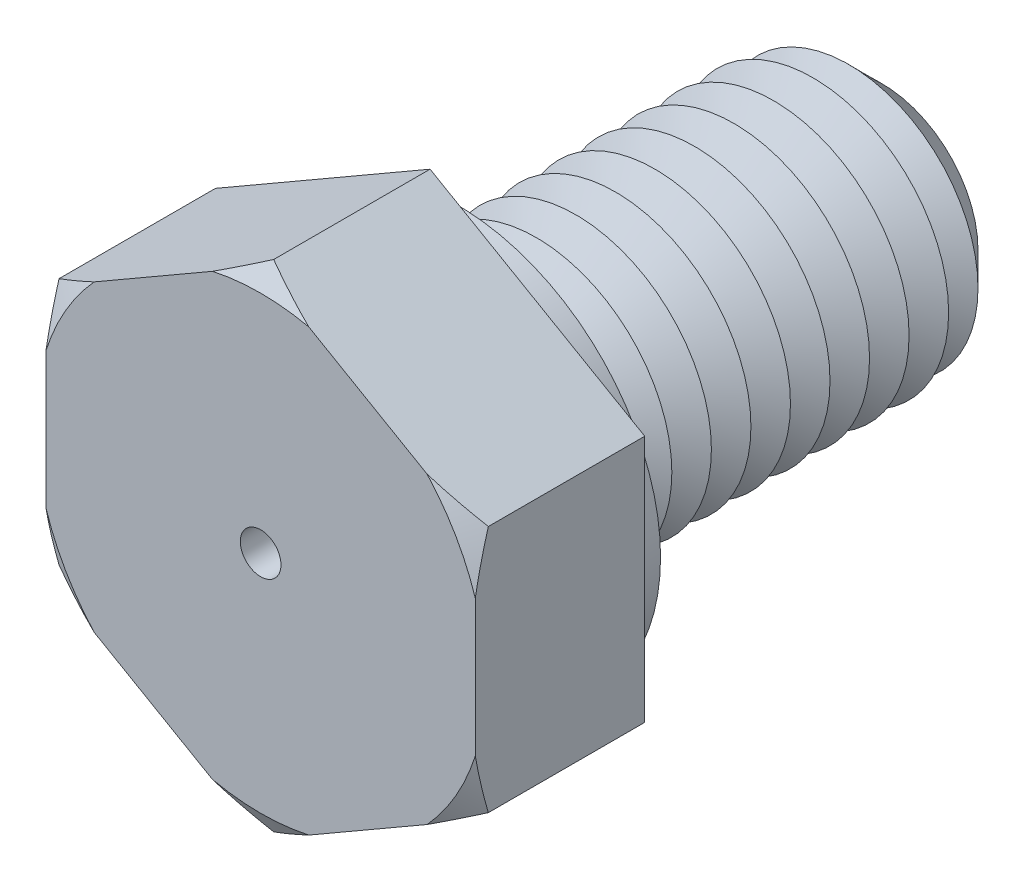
from build123d import *

# Parameters (mm, degrees)
BOSS_EXTRUDE1_DEPTH = 7.5
SKETCH3_R           = 6
BOSS_EXTRUDE2_DEPTH = 20
SKETCH4_R           = 9
BOSS_EXTRUDE3_DEPTH = 1.2
CHAMFER1_SIZE       = 1.75
LPATTERN1_COUNT     = 10
LPATTERN1_PITCH     = 1.75
SKETCH8_R           = 0.9
CUT_EXTRUDE1_DEPTH  = 27.5


with BuildPart() as part:
    # Sketch2 → Boss-Extrude1 (new body)
    with BuildSketch(Plane.XY):
        Polygon((0, 10.969655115), (-9.5, 5.484827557), (-9.5, -5.484827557), (0, -10.969655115), (9.5, -5.484827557), (9.5, 5.484827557), align=None)
    extrude(amount=BOSS_EXTRUDE1_DEPTH)

    # Sketch3 → Boss-Extrude2 (add)
    with BuildSketch(Plane(origin=(0, 0, 0), x_dir=(-1, 0, 0), z_dir=(0, 0, -1))):
        Circle(SKETCH3_R)
    extrude(amount=BOSS_EXTRUDE2_DEPTH)

    # Sketch4 → Boss-Extrude3 (add)
    with BuildSketch(Plane(origin=(0, 0, 0), x_dir=(-1, 0, 0), z_dir=(0, 0, -1))):
        with Locations(Location((0, 0, 0), (0, 0, 180))):
            Circle(SKETCH4_R)
    extrude(amount=BOSS_EXTRUDE3_DEPTH)

    # Chamfer1
    chamfer1_edges = [part.edges().sort_by_distance(p)[0] for p in [
        (6, 0, -20),
    ]]
    chamfer(chamfer1_edges, length=CHAMFER1_SIZE)

    # Sketch6 → Cut-Revolve1 (revolve, cut)
    with BuildSketch(Plane(origin=(0, 0, 0), x_dir=(0, 0, -1), z_dir=(1, 0, 0)), mode=Mode.PRIVATE) as cut_revolve1_sk:
        Polygon((1.2, 6), (2.075, 4.484455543), (2.95, 6), align=None)
    cut_revolve1 = revolve(cut_revolve1_sk.sketch.rotate(Axis((0, 0, 3.211670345), (0, 0, -1)), 90), axis=Axis((0, 0, 3.211670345), (0, 0, -1)), mode=Mode.SUBTRACT)

    # LPattern1: Cut-Revolve1 ×10
    with Locations(*[(0, 0, -i * LPATTERN1_PITCH) for i in range(1, LPATTERN1_COUNT)]):
        add(cut_revolve1, mode=Mode.SUBTRACT)

    # Sketch7 → Cut-Revolve2 (revolve, cut)
    with BuildSketch(Plane(origin=(0, 0, 0), x_dir=(0, 0, -1), z_dir=(1, 0, 0)), mode=Mode.PRIVATE) as cut_revolve2_sk:
        Polygon((-7.5, 10.969655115), (-7.5, 9.969655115), (-6.922649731, 10.969655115), align=None)
    revolve(cut_revolve2_sk.sketch.rotate(Axis((0, 0, 3.211670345), (0, 0, -1)), 90), axis=Axis((0, 0, 3.211670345), (0, 0, -1)), mode=Mode.SUBTRACT)

    # Sketch8 → Cut-Extrude1 (cut)
    with BuildSketch(Plane.XY.offset(7.5)):
        Circle(SKETCH8_R)
    extrude(amount=-CUT_EXTRUDE1_DEPTH, mode=Mode.SUBTRACT)


solid = part.part
